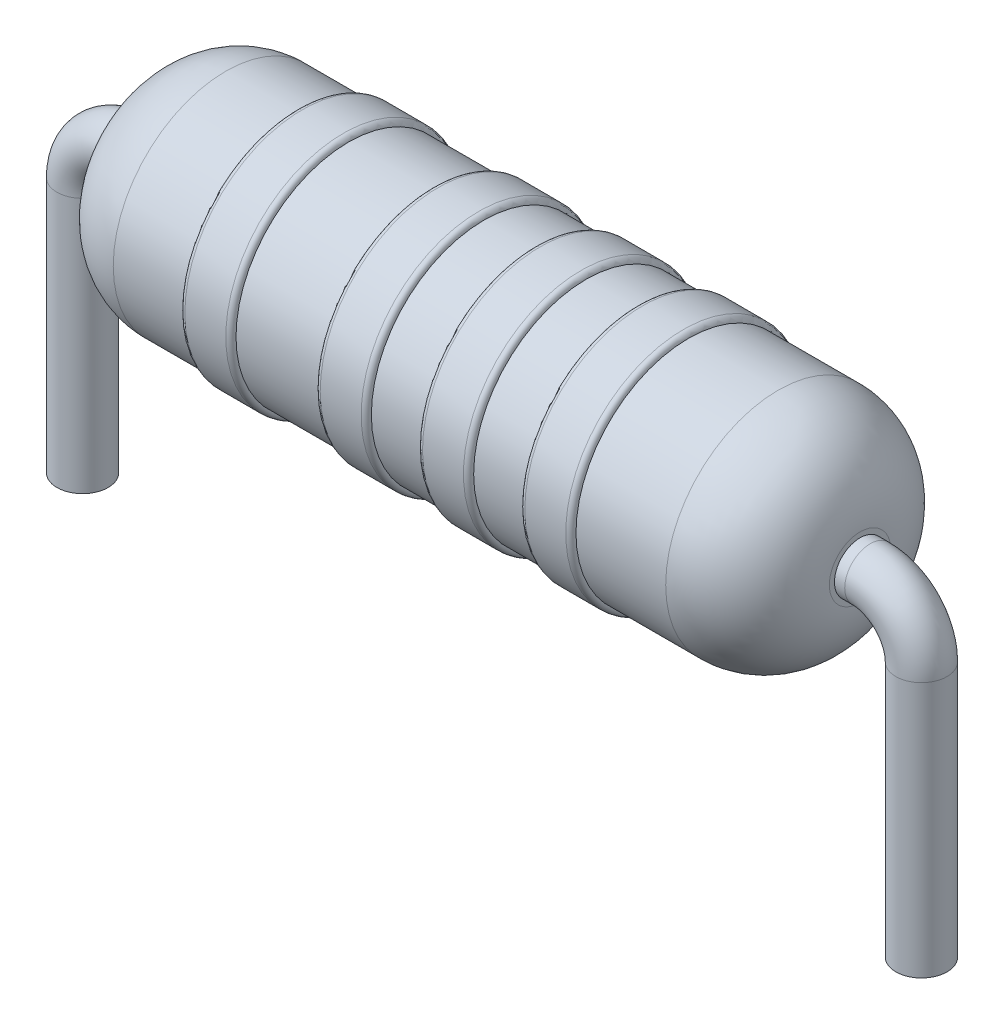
ISO-10303-21;
HEADER;
FILE_DESCRIPTION(('STEP AP214'),'2;1');
FILE_NAME('part.step','',(''),(''),'','','');
FILE_SCHEMA(('AUTOMOTIVE_DESIGN { 1 0 10303 214 1 1 1 1 }'));
ENDSEC;
DATA;
#1=APPLICATION_CONTEXT('core data for automotive mechanical design processes');
#2=APPLICATION_PROTOCOL_DEFINITION('international standard','automotive_design',2000,#1);
#3=PRODUCT_CONTEXT('',#1,'mechanical');
#4=PRODUCT('Part','Part','',(#3));
#5=PRODUCT_RELATED_PRODUCT_CATEGORY('part','',(#4));
#6=PRODUCT_DEFINITION_FORMATION('','',#4);
#7=PRODUCT_DEFINITION_CONTEXT('part definition',#1,'design');
#8=PRODUCT_DEFINITION('design','',#6,#7);
#9=PRODUCT_DEFINITION_SHAPE('','',#8);
#10=(LENGTH_UNIT() NAMED_UNIT(*) SI_UNIT(.MILLI.,.METRE.));
#11=(NAMED_UNIT(*) PLANE_ANGLE_UNIT() SI_UNIT($,.RADIAN.));
#12=(NAMED_UNIT(*) SI_UNIT($,.STERADIAN.) SOLID_ANGLE_UNIT());
#13=UNCERTAINTY_MEASURE_WITH_UNIT(LENGTH_MEASURE(1.E-05),#10,'distance_accuracy_value','');
#14=(GEOMETRIC_REPRESENTATION_CONTEXT(3) GLOBAL_UNCERTAINTY_ASSIGNED_CONTEXT((#13)) GLOBAL_UNIT_ASSIGNED_CONTEXT((#10,
#11,#12)) REPRESENTATION_CONTEXT('',''));
#15=CARTESIAN_POINT('',(0.,0.,0.));
#16=DIRECTION('',(0.,0.,1.));
#17=DIRECTION('',(1.,0.,0.));
#18=AXIS2_PLACEMENT_3D('',#15,#16,#17);
#19=CARTESIAN_POINT('',(-3.5,0.,0.));
#20=DIRECTION('',(1.,0.,0.));
#21=DIRECTION('',(0.,0.,-1.));
#22=AXIS2_PLACEMENT_3D('',#19,#20,#21);
#23=PLANE('',#22);
#24=CARTESIAN_POINT('',(-3.5,0.,0.));
#25=DIRECTION('',(-1.,0.,0.));
#26=DIRECTION('',(0.,0.,1.));
#27=AXIS2_PLACEMENT_3D('',#24,#25,#26);
#28=CIRCLE('',#27,0.299999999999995);
#29=CARTESIAN_POINT('',(-3.5,0.,0.299999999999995));
#30=VERTEX_POINT('',#29);
#31=EDGE_CURVE('E96',#30,#30,#28,.T.);
#32=ORIENTED_EDGE('',*,*,#31,.T.);
#33=EDGE_LOOP('',(#32));
#34=FACE_BOUND('',#33,.T.);
#35=CARTESIAN_POINT('',(-3.5,0.,0.));
#36=DIRECTION('',(1.,0.,0.));
#37=DIRECTION('',(0.,0.,-1.));
#38=AXIS2_PLACEMENT_3D('',#35,#36,#37);
#39=CIRCLE('',#38,0.25);
#40=CARTESIAN_POINT('',(-3.5,0.,-0.25));
#41=VERTEX_POINT('',#40);
#42=EDGE_CURVE('E10',#41,#41,#39,.F.);
#43=ORIENTED_EDGE('',*,*,#42,.F.);
#44=EDGE_LOOP('',(#43));
#45=FACE_BOUND('',#44,.T.);
#46=ADVANCED_FACE('F37',(#34,#45),#23,.F.);
#47=CARTESIAN_POINT('',(-54.2686615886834,0.,0.));
#48=DIRECTION('',(-1.,0.,0.));
#49=DIRECTION('',(0.,0.,1.));
#50=AXIS2_PLACEMENT_3D('',#47,#48,#49);
#51=CYLINDRICAL_SURFACE('',#50,1.1);
#52=CARTESIAN_POINT('',(0.322975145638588,0.,0.));
#53=DIRECTION('',(-1.,0.,0.));
#54=DIRECTION('',(0.,0.,1.));
#55=AXIS2_PLACEMENT_3D('',#52,#53,#54);
#56=CIRCLE('',#55,1.1);
#57=CARTESIAN_POINT('',(0.322975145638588,0.,1.1));
#58=VERTEX_POINT('',#57);
#59=EDGE_CURVE('E84',#58,#58,#56,.T.);
#60=ORIENTED_EDGE('',*,*,#59,.T.);
#61=EDGE_LOOP('',(#60));
#62=FACE_BOUND('',#61,.T.);
#63=CARTESIAN_POINT('',(-0.177024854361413,0.,0.));
#64=DIRECTION('',(1.,0.,0.));
#65=DIRECTION('',(0.,0.,-1.));
#66=AXIS2_PLACEMENT_3D('',#63,#64,#65);
#67=CIRCLE('',#66,1.1);
#68=CARTESIAN_POINT('',(-0.177024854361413,0.,-1.1));
#69=VERTEX_POINT('',#68);
#70=EDGE_CURVE('E93',#69,#69,#67,.T.);
#71=ORIENTED_EDGE('',*,*,#70,.T.);
#72=EDGE_LOOP('',(#71));
#73=FACE_BOUND('',#72,.T.);
#74=ADVANCED_FACE('F154',(#62,#73),#51,.T.);
#75=CARTESIAN_POINT('',(4.3261723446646,0.,0.));
#76=DIRECTION('',(1.,0.,0.));
#77=DIRECTION('',(0.,0.,-1.));
#78=AXIS2_PLACEMENT_3D('',#75,#76,#77);
#79=CYLINDRICAL_SURFACE('',#78,1.15);
#80=CARTESIAN_POINT('',(-0.627024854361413,0.,0.));
#81=DIRECTION('',(-1.,0.,0.));
#82=DIRECTION('',(0.,0.,1.));
#83=AXIS2_PLACEMENT_3D('',#80,#81,#82);
#84=CIRCLE('',#83,1.15);
#85=CARTESIAN_POINT('',(-0.627024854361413,0.,1.15));
#86=VERTEX_POINT('',#85);
#87=EDGE_CURVE('E60',#86,#86,#84,.F.);
#88=ORIENTED_EDGE('',*,*,#87,.T.);
#89=EDGE_LOOP('',(#88));
#90=FACE_BOUND('',#89,.T.);
#91=CARTESIAN_POINT('',(-0.227024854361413,0.,0.));
#92=DIRECTION('',(1.,0.,0.));
#93=DIRECTION('',(0.,0.,-1.));
#94=AXIS2_PLACEMENT_3D('',#91,#92,#93);
#95=CIRCLE('',#94,1.15);
#96=CARTESIAN_POINT('',(-0.227024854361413,0.,-1.15));
#97=VERTEX_POINT('',#96);
#98=EDGE_CURVE('E63',#97,#97,#95,.F.);
#99=ORIENTED_EDGE('',*,*,#98,.T.);
#100=EDGE_LOOP('',(#99));
#101=FACE_BOUND('',#100,.T.);
#102=ADVANCED_FACE('F160',(#90,#101),#79,.T.);
#103=CARTESIAN_POINT('',(-1.5,0.,0.));
#104=DIRECTION('',(1.,0.,0.));
#105=DIRECTION('',(0.,0.,-1.));
#106=AXIS2_PLACEMENT_3D('',#103,#104,#105);
#107=CIRCLE('',#106,1.1);
#108=CARTESIAN_POINT('',(-1.5,0.,-1.1));
#109=VERTEX_POINT('',#108);
#110=EDGE_CURVE('E77',#109,#109,#107,.T.);
#111=ORIENTED_EDGE('',*,*,#110,.T.);
#112=EDGE_LOOP('',(#111));
#113=FACE_BOUND('',#112,.T.);
#114=CARTESIAN_POINT('',(-0.677024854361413,0.,0.));
#115=DIRECTION('',(-1.,0.,0.));
#116=DIRECTION('',(0.,0.,1.));
#117=AXIS2_PLACEMENT_3D('',#114,#115,#116);
#118=CIRCLE('',#117,1.1);
#119=CARTESIAN_POINT('',(-0.677024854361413,0.,1.1));
#120=VERTEX_POINT('',#119);
#121=EDGE_CURVE('E90',#120,#120,#118,.T.);
#122=ORIENTED_EDGE('',*,*,#121,.T.);
#123=EDGE_LOOP('',(#122));
#124=FACE_BOUND('',#123,.T.);
#125=ADVANCED_FACE('F163',(#113,#124),#51,.T.);
#126=CARTESIAN_POINT('',(4.3261723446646,0.,0.));
#127=DIRECTION('',(1.,0.,0.));
#128=DIRECTION('',(0.,0.,-1.));
#129=AXIS2_PLACEMENT_3D('',#126,#127,#128);
#130=CYLINDRICAL_SURFACE('',#129,1.15);
#131=CARTESIAN_POINT('',(0.372975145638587,0.,0.));
#132=DIRECTION('',(-1.,0.,0.));
#133=DIRECTION('',(0.,0.,1.));
#134=AXIS2_PLACEMENT_3D('',#131,#132,#133);
#135=CIRCLE('',#134,1.15);
#136=CARTESIAN_POINT('',(0.372975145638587,0.,1.15));
#137=VERTEX_POINT('',#136);
#138=EDGE_CURVE('E52',#137,#137,#135,.F.);
#139=ORIENTED_EDGE('',*,*,#138,.T.);
#140=EDGE_LOOP('',(#139));
#141=FACE_BOUND('',#140,.T.);
#142=CARTESIAN_POINT('',(0.772975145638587,0.,0.));
#143=DIRECTION('',(1.,0.,0.));
#144=DIRECTION('',(0.,0.,-1.));
#145=AXIS2_PLACEMENT_3D('',#142,#143,#144);
#146=CIRCLE('',#145,1.15);
#147=CARTESIAN_POINT('',(0.772975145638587,0.,-1.15));
#148=VERTEX_POINT('',#147);
#149=EDGE_CURVE('E57',#148,#148,#146,.F.);
#150=ORIENTED_EDGE('',*,*,#149,.T.);
#151=EDGE_LOOP('',(#150));
#152=FACE_BOUND('',#151,.T.);
#153=ADVANCED_FACE('F176',(#141,#152),#130,.T.);
#154=CARTESIAN_POINT('',(1.32297514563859,0.,0.));
#155=DIRECTION('',(-1.,0.,0.));
#156=DIRECTION('',(0.,0.,1.));
#157=AXIS2_PLACEMENT_3D('',#154,#155,#156);
#158=CIRCLE('',#157,1.1);
#159=CARTESIAN_POINT('',(1.32297514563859,0.,1.1));
#160=VERTEX_POINT('',#159);
#161=EDGE_CURVE('E76',#160,#160,#158,.T.);
#162=ORIENTED_EDGE('',*,*,#161,.T.);
#163=EDGE_LOOP('',(#162));
#164=FACE_BOUND('',#163,.T.);
#165=CARTESIAN_POINT('',(0.822975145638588,0.,0.));
#166=DIRECTION('',(1.,0.,0.));
#167=DIRECTION('',(0.,0.,-1.));
#168=AXIS2_PLACEMENT_3D('',#165,#166,#167);
#169=CIRCLE('',#168,1.1);
#170=CARTESIAN_POINT('',(0.822975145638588,0.,-1.1));
#171=VERTEX_POINT('',#170);
#172=EDGE_CURVE('E87',#171,#171,#169,.T.);
#173=ORIENTED_EDGE('',*,*,#172,.T.);
#174=EDGE_LOOP('',(#173));
#175=FACE_BOUND('',#174,.T.);
#176=ADVANCED_FACE('F164',(#164,#175),#51,.T.);
#177=CARTESIAN_POINT('',(4.3261723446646,0.,0.));
#178=DIRECTION('',(1.,0.,0.));
#179=DIRECTION('',(0.,0.,-1.));
#180=AXIS2_PLACEMENT_3D('',#177,#178,#179);
#181=CYLINDRICAL_SURFACE('',#180,1.15);
#182=CARTESIAN_POINT('',(1.37297514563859,0.,0.));
#183=DIRECTION('',(-1.,0.,0.));
#184=DIRECTION('',(0.,0.,1.));
#185=AXIS2_PLACEMENT_3D('',#182,#183,#184);
#186=CIRCLE('',#185,1.15);
#187=CARTESIAN_POINT('',(1.37297514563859,0.,1.15));
#188=VERTEX_POINT('',#187);
#189=EDGE_CURVE('E44',#188,#188,#186,.F.);
#190=ORIENTED_EDGE('',*,*,#189,.T.);
#191=EDGE_LOOP('',(#190));
#192=FACE_BOUND('',#191,.T.);
#193=CARTESIAN_POINT('',(1.77297514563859,0.,0.));
#194=DIRECTION('',(1.,0.,0.));
#195=DIRECTION('',(0.,0.,-1.));
#196=AXIS2_PLACEMENT_3D('',#193,#194,#195);
#197=CIRCLE('',#196,1.15);
#198=CARTESIAN_POINT('',(1.77297514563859,0.,-1.15));
#199=VERTEX_POINT('',#198);
#200=EDGE_CURVE('E48',#199,#199,#197,.F.);
#201=ORIENTED_EDGE('',*,*,#200,.T.);
#202=EDGE_LOOP('',(#201));
#203=FACE_BOUND('',#202,.T.);
#204=ADVANCED_FACE('F186',(#192,#203),#181,.T.);
#205=CARTESIAN_POINT('',(3.5,0.299999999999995,0.));
#206=DIRECTION('',(-1.,0.,0.));
#207=DIRECTION('',(0.,0.,1.));
#208=AXIS2_PLACEMENT_3D('',#205,#206,#207);
#209=PLANE('',#208);
#210=CARTESIAN_POINT('',(3.5,0.,0.));
#211=DIRECTION('',(-1.,0.,0.));
#212=DIRECTION('',(0.,0.,1.));
#213=AXIS2_PLACEMENT_3D('',#210,#211,#212);
#214=CIRCLE('',#213,0.25);
#215=CARTESIAN_POINT('',(3.5,0.,0.25));
#216=VERTEX_POINT('',#215);
#217=EDGE_CURVE('E124',#216,#216,#214,.T.);
#218=ORIENTED_EDGE('',*,*,#217,.T.);
#219=EDGE_LOOP('',(#218));
#220=FACE_BOUND('',#219,.T.);
#221=CARTESIAN_POINT('',(3.5,0.,0.));
#222=DIRECTION('',(-1.,0.,0.));
#223=DIRECTION('',(0.,0.,1.));
#224=AXIS2_PLACEMENT_3D('',#221,#222,#223);
#225=CIRCLE('',#224,0.299999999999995);
#226=CARTESIAN_POINT('',(3.5,0.,0.299999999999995));
#227=VERTEX_POINT('',#226);
#228=EDGE_CURVE('E72',#227,#227,#225,.T.);
#229=ORIENTED_EDGE('',*,*,#228,.F.);
#230=EDGE_LOOP('',(#229));
#231=FACE_BOUND('',#230,.T.);
#232=ADVANCED_FACE('F182',(#220,#231),#209,.F.);
#233=CARTESIAN_POINT('',(2.7,0.,0.));
#234=DIRECTION('',(-1.,0.,0.));
#235=DIRECTION('',(0.,0.,1.));
#236=AXIS2_PLACEMENT_3D('',#233,#234,#235);
#237=DEGENERATE_TOROIDAL_SURFACE('',#236,0.3,0.8,.T.);
#238=CARTESIAN_POINT('',(2.69999999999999,0.,0.));
#239=DIRECTION('',(-1.,0.,0.));
#240=DIRECTION('',(0.,0.,1.));
#241=AXIS2_PLACEMENT_3D('',#238,#239,#240);
#242=CIRCLE('',#241,1.1);
#243=CARTESIAN_POINT('',(2.69999999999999,0.,1.1));
#244=VERTEX_POINT('',#243);
#245=EDGE_CURVE('E101',#244,#244,#242,.T.);
#246=ORIENTED_EDGE('',*,*,#245,.F.);
#247=EDGE_LOOP('',(#246));
#248=FACE_BOUND('',#247,.T.);
#249=ORIENTED_EDGE('',*,*,#228,.T.);
#250=EDGE_LOOP('',(#249));
#251=FACE_BOUND('',#250,.T.);
#252=ADVANCED_FACE('F178',(#248,#251),#237,.T.);
#253=CARTESIAN_POINT('',(1.82297514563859,0.,0.));
#254=DIRECTION('',(1.,0.,0.));
#255=DIRECTION('',(0.,0.,-1.));
#256=AXIS2_PLACEMENT_3D('',#253,#254,#255);
#257=CIRCLE('',#256,1.1);
#258=CARTESIAN_POINT('',(1.82297514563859,0.,-1.1));
#259=VERTEX_POINT('',#258);
#260=EDGE_CURVE('E81',#259,#259,#257,.T.);
#261=ORIENTED_EDGE('',*,*,#260,.T.);
#262=EDGE_LOOP('',(#261));
#263=FACE_BOUND('',#262,.T.);
#264=ORIENTED_EDGE('',*,*,#245,.T.);
#265=EDGE_LOOP('',(#264));
#266=FACE_BOUND('',#265,.T.);
#267=ADVANCED_FACE('F181',(#263,#266),#51,.T.);
#268=CARTESIAN_POINT('',(4.3261723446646,0.,0.));
#269=DIRECTION('',(1.,0.,0.));
#270=DIRECTION('',(0.,0.,-1.));
#271=AXIS2_PLACEMENT_3D('',#268,#269,#270);
#272=CYLINDRICAL_SURFACE('',#271,1.15);
#273=CARTESIAN_POINT('',(-1.95,0.,0.));
#274=DIRECTION('',(-1.,0.,0.));
#275=DIRECTION('',(0.,0.,1.));
#276=AXIS2_PLACEMENT_3D('',#273,#274,#275);
#277=CIRCLE('',#276,1.15);
#278=CARTESIAN_POINT('',(-1.95,0.,1.15));
#279=VERTEX_POINT('',#278);
#280=EDGE_CURVE('E66',#279,#279,#277,.F.);
#281=ORIENTED_EDGE('',*,*,#280,.T.);
#282=EDGE_LOOP('',(#281));
#283=FACE_BOUND('',#282,.T.);
#284=CARTESIAN_POINT('',(-1.55,0.,0.));
#285=DIRECTION('',(1.,0.,0.));
#286=DIRECTION('',(0.,0.,-1.));
#287=AXIS2_PLACEMENT_3D('',#284,#285,#286);
#288=CIRCLE('',#287,1.15);
#289=CARTESIAN_POINT('',(-1.55,0.,-1.15));
#290=VERTEX_POINT('',#289);
#291=EDGE_CURVE('E69',#290,#290,#288,.F.);
#292=ORIENTED_EDGE('',*,*,#291,.T.);
#293=EDGE_LOOP('',(#292));
#294=FACE_BOUND('',#293,.T.);
#295=ADVANCED_FACE('F172',(#283,#294),#272,.T.);
#296=CARTESIAN_POINT('',(-2.7,0.,0.));
#297=DIRECTION('',(-1.,0.,0.));
#298=DIRECTION('',(0.,0.,1.));
#299=AXIS2_PLACEMENT_3D('',#296,#297,#298);
#300=DEGENERATE_TOROIDAL_SURFACE('',#299,0.3,0.8,.T.);
#301=ORIENTED_EDGE('',*,*,#31,.F.);
#302=EDGE_LOOP('',(#301));
#303=FACE_BOUND('',#302,.T.);
#304=CARTESIAN_POINT('',(-2.69999999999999,0.,0.));
#305=DIRECTION('',(-1.,0.,0.));
#306=DIRECTION('',(0.,0.,1.));
#307=AXIS2_PLACEMENT_3D('',#304,#305,#306);
#308=CIRCLE('',#307,1.1);
#309=CARTESIAN_POINT('',(-2.69999999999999,0.,1.1));
#310=VERTEX_POINT('',#309);
#311=EDGE_CURVE('E104',#310,#310,#308,.T.);
#312=ORIENTED_EDGE('',*,*,#311,.T.);
#313=EDGE_LOOP('',(#312));
#314=FACE_BOUND('',#313,.T.);
#315=ADVANCED_FACE('F169',(#303,#314),#300,.T.);
#316=CARTESIAN_POINT('',(-2.,0.,0.));
#317=DIRECTION('',(-1.,0.,0.));
#318=DIRECTION('',(0.,0.,1.));
#319=AXIS2_PLACEMENT_3D('',#316,#317,#318);
#320=CIRCLE('',#319,1.1);
#321=CARTESIAN_POINT('',(-2.,0.,1.1));
#322=VERTEX_POINT('',#321);
#323=EDGE_CURVE('E73',#322,#322,#320,.T.);
#324=ORIENTED_EDGE('',*,*,#323,.T.);
#325=EDGE_LOOP('',(#324));
#326=FACE_BOUND('',#325,.T.);
#327=ORIENTED_EDGE('',*,*,#311,.F.);
#328=EDGE_LOOP('',(#327));
#329=FACE_BOUND('',#328,.T.);
#330=ADVANCED_FACE('F171',(#326,#329),#51,.T.);
#331=CARTESIAN_POINT('',(-1.95,0.,0.));
#332=DIRECTION('',(-1.,0.,0.));
#333=DIRECTION('',(0.,0.,1.));
#334=AXIS2_PLACEMENT_3D('',#331,#332,#333);
#335=TOROIDAL_SURFACE('',#334,1.1,0.05);
#336=ORIENTED_EDGE('',*,*,#323,.F.);
#337=EDGE_LOOP('',(#336));
#338=FACE_BOUND('',#337,.T.);
#339=ORIENTED_EDGE('',*,*,#280,.F.);
#340=EDGE_LOOP('',(#339));
#341=FACE_BOUND('',#340,.T.);
#342=ADVANCED_FACE('F188',(#338,#341),#335,.T.);
#343=CARTESIAN_POINT('',(-1.55,0.,0.));
#344=DIRECTION('',(1.,0.,0.));
#345=DIRECTION('',(0.,0.,-1.));
#346=AXIS2_PLACEMENT_3D('',#343,#344,#345);
#347=TOROIDAL_SURFACE('',#346,1.1,0.05);
#348=ORIENTED_EDGE('',*,*,#291,.F.);
#349=EDGE_LOOP('',(#348));
#350=FACE_BOUND('',#349,.T.);
#351=ORIENTED_EDGE('',*,*,#110,.F.);
#352=EDGE_LOOP('',(#351));
#353=FACE_BOUND('',#352,.T.);
#354=ADVANCED_FACE('F191',(#350,#353),#347,.T.);
#355=CARTESIAN_POINT('',(-0.627024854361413,0.,0.));
#356=DIRECTION('',(-1.,0.,0.));
#357=DIRECTION('',(0.,0.,1.));
#358=AXIS2_PLACEMENT_3D('',#355,#356,#357);
#359=TOROIDAL_SURFACE('',#358,1.1,0.05);
#360=ORIENTED_EDGE('',*,*,#121,.F.);
#361=EDGE_LOOP('',(#360));
#362=FACE_BOUND('',#361,.T.);
#363=ORIENTED_EDGE('',*,*,#87,.F.);
#364=EDGE_LOOP('',(#363));
#365=FACE_BOUND('',#364,.T.);
#366=ADVANCED_FACE('F195',(#362,#365),#359,.T.);
#367=CARTESIAN_POINT('',(-0.227024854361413,0.,0.));
#368=DIRECTION('',(1.,0.,0.));
#369=DIRECTION('',(0.,0.,-1.));
#370=AXIS2_PLACEMENT_3D('',#367,#368,#369);
#371=TOROIDAL_SURFACE('',#370,1.1,0.05);
#372=ORIENTED_EDGE('',*,*,#98,.F.);
#373=EDGE_LOOP('',(#372));
#374=FACE_BOUND('',#373,.T.);
#375=ORIENTED_EDGE('',*,*,#70,.F.);
#376=EDGE_LOOP('',(#375));
#377=FACE_BOUND('',#376,.T.);
#378=ADVANCED_FACE('F199',(#374,#377),#371,.T.);
#379=CARTESIAN_POINT('',(0.372975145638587,0.,0.));
#380=DIRECTION('',(-1.,0.,0.));
#381=DIRECTION('',(0.,0.,1.));
#382=AXIS2_PLACEMENT_3D('',#379,#380,#381);
#383=TOROIDAL_SURFACE('',#382,1.1,0.05);
#384=ORIENTED_EDGE('',*,*,#59,.F.);
#385=EDGE_LOOP('',(#384));
#386=FACE_BOUND('',#385,.T.);
#387=ORIENTED_EDGE('',*,*,#138,.F.);
#388=EDGE_LOOP('',(#387));
#389=FACE_BOUND('',#388,.T.);
#390=ADVANCED_FACE('F203',(#386,#389),#383,.T.);
#391=CARTESIAN_POINT('',(0.772975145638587,0.,0.));
#392=DIRECTION('',(1.,0.,0.));
#393=DIRECTION('',(0.,0.,-1.));
#394=AXIS2_PLACEMENT_3D('',#391,#392,#393);
#395=TOROIDAL_SURFACE('',#394,1.1,0.05);
#396=ORIENTED_EDGE('',*,*,#149,.F.);
#397=EDGE_LOOP('',(#396));
#398=FACE_BOUND('',#397,.T.);
#399=ORIENTED_EDGE('',*,*,#172,.F.);
#400=EDGE_LOOP('',(#399));
#401=FACE_BOUND('',#400,.T.);
#402=ADVANCED_FACE('F207',(#398,#401),#395,.T.);
#403=CARTESIAN_POINT('',(1.37297514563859,0.,0.));
#404=DIRECTION('',(-1.,0.,0.));
#405=DIRECTION('',(0.,0.,1.));
#406=AXIS2_PLACEMENT_3D('',#403,#404,#405);
#407=TOROIDAL_SURFACE('',#406,1.1,0.05);
#408=ORIENTED_EDGE('',*,*,#161,.F.);
#409=EDGE_LOOP('',(#408));
#410=FACE_BOUND('',#409,.T.);
#411=ORIENTED_EDGE('',*,*,#189,.F.);
#412=EDGE_LOOP('',(#411));
#413=FACE_BOUND('',#412,.T.);
#414=ADVANCED_FACE('F210',(#410,#413),#407,.T.);
#415=CARTESIAN_POINT('',(1.77297514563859,0.,0.));
#416=DIRECTION('',(1.,0.,0.));
#417=DIRECTION('',(0.,0.,-1.));
#418=AXIS2_PLACEMENT_3D('',#415,#416,#417);
#419=TOROIDAL_SURFACE('',#418,1.1,0.05);
#420=ORIENTED_EDGE('',*,*,#200,.F.);
#421=EDGE_LOOP('',(#420));
#422=FACE_BOUND('',#421,.T.);
#423=ORIENTED_EDGE('',*,*,#260,.F.);
#424=EDGE_LOOP('',(#423));
#425=FACE_BOUND('',#424,.T.);
#426=ADVANCED_FACE('F39',(#422,#425),#419,.T.);
#427=CARTESIAN_POINT('',(-4.1,-0.500000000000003,0.));
#428=DIRECTION('',(0.,-1.,0.));
#429=DIRECTION('',(0.,0.,-1.));
#430=AXIS2_PLACEMENT_3D('',#427,#428,#429);
#431=CYLINDRICAL_SURFACE('',#430,0.25);
#432=CARTESIAN_POINT('',(-4.1,-0.500000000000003,0.));
#433=DIRECTION('',(0.,-1.,0.));
#434=DIRECTION('',(0.,0.,1.));
#435=AXIS2_PLACEMENT_3D('',#432,#433,#434);
#436=CIRCLE('',#435,0.25);
#437=CARTESIAN_POINT('',(-4.35,-0.500000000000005,0.));
#438=VERTEX_POINT('',#437);
#439=EDGE_CURVE('E111',#438,#438,#436,.T.);
#440=ORIENTED_EDGE('',*,*,#439,.T.);
#441=EDGE_LOOP('',(#440));
#442=FACE_BOUND('',#441,.T.);
#443=CARTESIAN_POINT('',(-4.1,-3.,0.));
#444=DIRECTION('',(0.,-1.,0.));
#445=DIRECTION('',(0.,0.,1.));
#446=AXIS2_PLACEMENT_3D('',#443,#444,#445);
#447=CIRCLE('',#446,0.25);
#448=CARTESIAN_POINT('',(-4.1,-3.,0.25));
#449=VERTEX_POINT('',#448);
#450=EDGE_CURVE('E80',#449,#449,#447,.T.);
#451=ORIENTED_EDGE('',*,*,#450,.F.);
#452=EDGE_LOOP('',(#451));
#453=FACE_BOUND('',#452,.T.);
#454=ADVANCED_FACE('F217',(#442,#453),#431,.T.);
#455=CARTESIAN_POINT('',(-3.6,-0.5,0.));
#456=DIRECTION('',(0.,0.,1.));
#457=DIRECTION('',(1.,0.,0.));
#458=AXIS2_PLACEMENT_3D('',#455,#456,#457);
#459=TOROIDAL_SURFACE('',#458,0.5,0.25);
#460=CARTESIAN_POINT('',(-3.6,0.,0.));
#461=DIRECTION('',(-1.,0.,0.));
#462=DIRECTION('',(0.,0.,1.));
#463=AXIS2_PLACEMENT_3D('',#460,#461,#462);
#464=CIRCLE('',#463,0.25);
#465=CARTESIAN_POINT('',(-3.59999999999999,0.25,0.));
#466=VERTEX_POINT('',#465);
#467=EDGE_CURVE('E114',#466,#466,#464,.T.);
#468=CARTESIAN_POINT('',(-3.6,-0.5,0.));
#469=DIRECTION('',(0.,0.,1.));
#470=DIRECTION('',(1.,0.,0.));
#471=AXIS2_PLACEMENT_3D('',#468,#469,#470);
#472=CIRCLE('',#471,0.75);
#473=EDGE_CURVE('',#466,#438,#472,.T.);
#474=ORIENTED_EDGE('',*,*,#467,.T.);
#475=ORIENTED_EDGE('',*,*,#439,.F.);
#476=ORIENTED_EDGE('',*,*,#473,.T.);
#477=ORIENTED_EDGE('',*,*,#473,.F.);
#478=EDGE_LOOP('',(#474,#476,#475,#477));
#479=FACE_BOUND('',#478,.T.);
#480=ADVANCED_FACE('F359',(#479),#459,.T.);
#481=CARTESIAN_POINT('',(-3.6,0.,0.));
#482=DIRECTION('',(1.,0.,0.));
#483=DIRECTION('',(0.,0.,-1.));
#484=AXIS2_PLACEMENT_3D('',#481,#482,#483);
#485=CYLINDRICAL_SURFACE('',#484,0.25);
#486=ORIENTED_EDGE('',*,*,#467,.F.);
#487=EDGE_LOOP('',(#486));
#488=FACE_BOUND('',#487,.T.);
#489=ORIENTED_EDGE('',*,*,#42,.T.);
#490=EDGE_LOOP('',(#489));
#491=FACE_BOUND('',#490,.T.);
#492=ADVANCED_FACE('F370',(#488,#491),#485,.T.);
#493=CARTESIAN_POINT('',(-4.1,-3.,0.));
#494=DIRECTION('',(0.,-1.,0.));
#495=DIRECTION('',(0.,0.,1.));
#496=AXIS2_PLACEMENT_3D('',#493,#494,#495);
#497=PLANE('',#496);
#498=ORIENTED_EDGE('',*,*,#450,.T.);
#499=EDGE_LOOP('',(#498));
#500=FACE_BOUND('',#499,.T.);
#501=ADVANCED_FACE('F142',(#500),#497,.T.);
#502=CARTESIAN_POINT('',(4.1,-0.500000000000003,0.));
#503=DIRECTION('',(0.,-1.,0.));
#504=DIRECTION('',(0.,0.,-1.));
#505=AXIS2_PLACEMENT_3D('',#502,#503,#504);
#506=CYLINDRICAL_SURFACE('',#505,0.25);
#507=CARTESIAN_POINT('',(4.1,-0.500000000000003,0.));
#508=DIRECTION('',(0.,1.,0.));
#509=DIRECTION('',(0.,0.,1.));
#510=AXIS2_PLACEMENT_3D('',#507,#508,#509);
#511=CIRCLE('',#510,0.25);
#512=CARTESIAN_POINT('',(4.35,-0.500000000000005,0.));
#513=VERTEX_POINT('',#512);
#514=EDGE_CURVE('E120',#513,#513,#511,.T.);
#515=ORIENTED_EDGE('',*,*,#514,.F.);
#516=EDGE_LOOP('',(#515));
#517=FACE_BOUND('',#516,.T.);
#518=CARTESIAN_POINT('',(4.1,-3.,0.));
#519=DIRECTION('',(0.,1.,0.));
#520=DIRECTION('',(0.,0.,1.));
#521=AXIS2_PLACEMENT_3D('',#518,#519,#520);
#522=CIRCLE('',#521,0.25);
#523=CARTESIAN_POINT('',(4.1,-3.,0.25));
#524=VERTEX_POINT('',#523);
#525=EDGE_CURVE('E117',#524,#524,#522,.T.);
#526=ORIENTED_EDGE('',*,*,#525,.T.);
#527=EDGE_LOOP('',(#526));
#528=FACE_BOUND('',#527,.T.);
#529=ADVANCED_FACE('F136',(#517,#528),#506,.T.);
#530=CARTESIAN_POINT('',(3.6,-0.5,0.));
#531=DIRECTION('',(0.,0.,-1.));
#532=DIRECTION('',(-1.,0.,0.));
#533=AXIS2_PLACEMENT_3D('',#530,#531,#532);
#534=TOROIDAL_SURFACE('',#533,0.5,0.25);
#535=CARTESIAN_POINT('',(3.6,0.,0.));
#536=DIRECTION('',(-1.,0.,0.));
#537=DIRECTION('',(0.,0.,1.));
#538=AXIS2_PLACEMENT_3D('',#535,#536,#537);
#539=CIRCLE('',#538,0.25);
#540=CARTESIAN_POINT('',(3.59999999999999,0.25,0.));
#541=VERTEX_POINT('',#540);
#542=EDGE_CURVE('E123',#541,#541,#539,.T.);
#543=CARTESIAN_POINT('',(3.6,-0.5,0.));
#544=DIRECTION('',(0.,0.,-1.));
#545=DIRECTION('',(-1.,0.,0.));
#546=AXIS2_PLACEMENT_3D('',#543,#544,#545);
#547=CIRCLE('',#546,0.75);
#548=EDGE_CURVE('',#541,#513,#547,.T.);
#549=ORIENTED_EDGE('',*,*,#542,.F.);
#550=ORIENTED_EDGE('',*,*,#514,.T.);
#551=ORIENTED_EDGE('',*,*,#548,.T.);
#552=ORIENTED_EDGE('',*,*,#548,.F.);
#553=EDGE_LOOP('',(#549,#551,#550,#552));
#554=FACE_BOUND('',#553,.T.);
#555=ADVANCED_FACE('F133',(#554),#534,.T.);
#556=CARTESIAN_POINT('',(3.6,0.,0.));
#557=DIRECTION('',(-1.,0.,0.));
#558=DIRECTION('',(0.,0.,1.));
#559=AXIS2_PLACEMENT_3D('',#556,#557,#558);
#560=CYLINDRICAL_SURFACE('',#559,0.25);
#561=ORIENTED_EDGE('',*,*,#542,.T.);
#562=EDGE_LOOP('',(#561));
#563=FACE_BOUND('',#562,.T.);
#564=ORIENTED_EDGE('',*,*,#217,.F.);
#565=EDGE_LOOP('',(#564));
#566=FACE_BOUND('',#565,.T.);
#567=ADVANCED_FACE('F130',(#563,#566),#560,.T.);
#568=CARTESIAN_POINT('',(4.1,-3.,0.));
#569=DIRECTION('',(0.,-1.,0.));
#570=DIRECTION('',(0.,0.,1.));
#571=AXIS2_PLACEMENT_3D('',#568,#569,#570);
#572=PLANE('',#571);
#573=ORIENTED_EDGE('',*,*,#525,.F.);
#574=EDGE_LOOP('',(#573));
#575=FACE_BOUND('',#574,.T.);
#576=ADVANCED_FACE('F146',(#575),#572,.T.);
#577=CLOSED_SHELL('',(#46,#74,#102,#125,#153,#176,#204,#232,#252,#267,#295,#315,#330,#342,#354,
#366,#378,#390,#402,#414,#426,#454,#480,#492,#501,#529,#555,#567,#576));
#578=MANIFOLD_SOLID_BREP('B2',#577);
#579=ADVANCED_BREP_SHAPE_REPRESENTATION('',(#18,#578),#14);
#580=SHAPE_DEFINITION_REPRESENTATION(#9,#579);
ENDSEC;
END-ISO-10303-21;
